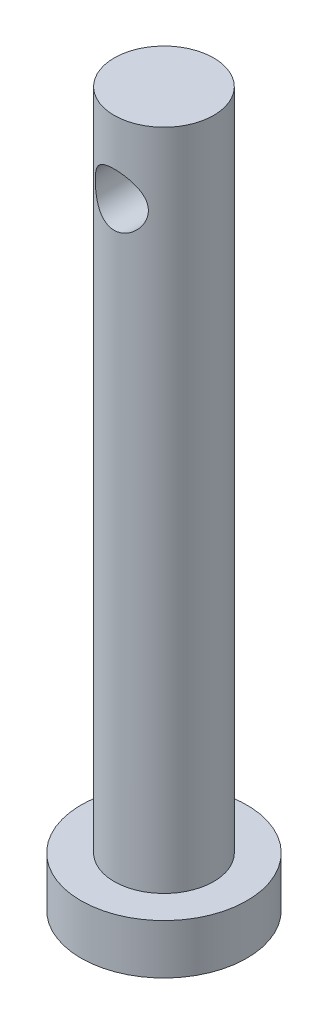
ISO-10303-21;
HEADER;
FILE_DESCRIPTION(('STEP AP214'),'2;1');
FILE_NAME('part.step','',(''),(''),'','','');
FILE_SCHEMA(('AUTOMOTIVE_DESIGN { 1 0 10303 214 1 1 1 1 }'));
ENDSEC;
DATA;
#1=APPLICATION_CONTEXT('core data for automotive mechanical design processes');
#2=APPLICATION_PROTOCOL_DEFINITION('international standard','automotive_design',2000,#1);
#3=PRODUCT_CONTEXT('',#1,'mechanical');
#4=PRODUCT('Part','Part','',(#3));
#5=PRODUCT_RELATED_PRODUCT_CATEGORY('part','',(#4));
#6=PRODUCT_DEFINITION_FORMATION('','',#4);
#7=PRODUCT_DEFINITION_CONTEXT('part definition',#1,'design');
#8=PRODUCT_DEFINITION('design','',#6,#7);
#9=PRODUCT_DEFINITION_SHAPE('','',#8);
#10=(LENGTH_UNIT() NAMED_UNIT(*) SI_UNIT(.MILLI.,.METRE.));
#11=(NAMED_UNIT(*) PLANE_ANGLE_UNIT() SI_UNIT($,.RADIAN.));
#12=(NAMED_UNIT(*) SI_UNIT($,.STERADIAN.) SOLID_ANGLE_UNIT());
#13=UNCERTAINTY_MEASURE_WITH_UNIT(LENGTH_MEASURE(1.E-05),#10,'distance_accuracy_value','');
#14=(GEOMETRIC_REPRESENTATION_CONTEXT(3) GLOBAL_UNCERTAINTY_ASSIGNED_CONTEXT((#13)) GLOBAL_UNIT_ASSIGNED_CONTEXT((#10,
#11,#12)) REPRESENTATION_CONTEXT('',''));
#15=CARTESIAN_POINT('',(0.,0.,0.));
#16=DIRECTION('',(0.,0.,1.));
#17=DIRECTION('',(1.,0.,0.));
#18=AXIS2_PLACEMENT_3D('',#15,#16,#17);
#19=CARTESIAN_POINT('',(-1.5,21.5,0.));
#20=DIRECTION('',(0.,1.,0.));
#21=DIRECTION('',(1.,0.,0.));
#22=AXIS2_PLACEMENT_3D('',#19,#20,#21);
#23=PLANE('',#22);
#24=CARTESIAN_POINT('',(0.,21.5,0.));
#25=DIRECTION('',(0.,1.,0.));
#26=DIRECTION('',(0.,0.,1.));
#27=AXIS2_PLACEMENT_3D('',#24,#25,#26);
#28=CIRCLE('',#27,1.5);
#29=CARTESIAN_POINT('',(0.,21.5,1.5));
#30=VERTEX_POINT('',#29);
#31=EDGE_CURVE('E38',#30,#30,#28,.T.);
#32=ORIENTED_EDGE('',*,*,#31,.T.);
#33=EDGE_LOOP('',(#32));
#34=FACE_BOUND('',#33,.T.);
#35=ADVANCED_FACE('F15',(#34),#23,.T.);
#36=CARTESIAN_POINT('',(-2.5,1.5,0.));
#37=DIRECTION('',(0.,1.,0.));
#38=DIRECTION('',(1.,0.,0.));
#39=AXIS2_PLACEMENT_3D('',#36,#37,#38);
#40=PLANE('',#39);
#41=CARTESIAN_POINT('',(0.,1.5,0.));
#42=DIRECTION('',(0.,1.,0.));
#43=DIRECTION('',(0.,0.,1.));
#44=AXIS2_PLACEMENT_3D('',#41,#42,#43);
#45=CIRCLE('',#44,1.5);
#46=CARTESIAN_POINT('',(0.,1.5,1.5));
#47=VERTEX_POINT('',#46);
#48=EDGE_CURVE('E47',#47,#47,#45,.T.);
#49=ORIENTED_EDGE('',*,*,#48,.F.);
#50=EDGE_LOOP('',(#49));
#51=FACE_BOUND('',#50,.T.);
#52=CARTESIAN_POINT('',(0.,1.5,0.));
#53=DIRECTION('',(0.,1.,0.));
#54=DIRECTION('',(0.,0.,1.));
#55=AXIS2_PLACEMENT_3D('',#52,#53,#54);
#56=CIRCLE('',#55,2.5);
#57=CARTESIAN_POINT('',(0.,1.5,2.5));
#58=VERTEX_POINT('',#57);
#59=EDGE_CURVE('E10',#58,#58,#56,.T.);
#60=ORIENTED_EDGE('',*,*,#59,.T.);
#61=EDGE_LOOP('',(#60));
#62=FACE_BOUND('',#61,.T.);
#63=ADVANCED_FACE('F67',(#51,#62),#40,.T.);
#64=CARTESIAN_POINT('',(0.,0.,0.));
#65=DIRECTION('',(0.,-1.,0.));
#66=DIRECTION('',(0.,0.,-1.));
#67=AXIS2_PLACEMENT_3D('',#64,#65,#66);
#68=PLANE('',#67);
#69=CARTESIAN_POINT('',(0.,0.,0.));
#70=DIRECTION('',(0.,1.,0.));
#71=DIRECTION('',(0.,0.,1.));
#72=AXIS2_PLACEMENT_3D('',#69,#70,#71);
#73=CIRCLE('',#72,2.5);
#74=CARTESIAN_POINT('',(0.,0.,2.5));
#75=VERTEX_POINT('',#74);
#76=EDGE_CURVE('E28',#75,#75,#73,.T.);
#77=ORIENTED_EDGE('',*,*,#76,.F.);
#78=EDGE_LOOP('',(#77));
#79=FACE_BOUND('',#78,.T.);
#80=ADVANCED_FACE('F59',(#79),#68,.T.);
#81=CARTESIAN_POINT('',(0.,0.,0.));
#82=DIRECTION('',(0.,1.,0.));
#83=DIRECTION('',(0.,0.,1.));
#84=AXIS2_PLACEMENT_3D('',#81,#82,#83);
#85=CYLINDRICAL_SURFACE('',#84,2.5);
#86=ORIENTED_EDGE('',*,*,#59,.F.);
#87=EDGE_LOOP('',(#86));
#88=FACE_BOUND('',#87,.T.);
#89=ORIENTED_EDGE('',*,*,#76,.T.);
#90=EDGE_LOOP('',(#89));
#91=FACE_BOUND('',#90,.T.);
#92=ADVANCED_FACE('F56',(#88,#91),#85,.T.);
#93=CARTESIAN_POINT('',(0.,0.,0.));
#94=DIRECTION('',(0.,1.,0.));
#95=DIRECTION('',(0.,0.,1.));
#96=AXIS2_PLACEMENT_3D('',#93,#94,#95);
#97=CYLINDRICAL_SURFACE('',#96,1.5);
#98=CARTESIAN_POINT('',(0.,18.5,-1.5));
#99=CARTESIAN_POINT('',(-0.0417534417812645,18.5000008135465,-1.49999924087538));
#100=CARTESIAN_POINT('',(-0.083514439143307,18.5032844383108,-1.49824053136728));
#101=CARTESIAN_POINT('',(-0.165754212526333,18.5162519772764,-1.49138572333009));
#102=CARTESIAN_POINT('',(-0.206232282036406,18.5259393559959,-1.48628781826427));
#103=CARTESIAN_POINT('',(-0.284636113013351,18.5512184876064,-1.47328110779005));
#104=CARTESIAN_POINT('',(-0.322570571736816,18.5667887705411,-1.46538252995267));
#105=CARTESIAN_POINT('',(-0.395228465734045,18.6032585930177,-1.44747938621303));
#106=CARTESIAN_POINT('',(-0.429951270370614,18.6241591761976,-1.43747440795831));
#107=CARTESIAN_POINT('',(-0.497766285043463,18.6722506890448,-1.41547938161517));
#108=CARTESIAN_POINT('',(-0.530599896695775,18.6997655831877,-1.40340192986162));
#109=CARTESIAN_POINT('',(-0.59143221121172,18.7596012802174,-1.37887123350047));
#110=CARTESIAN_POINT('',(-0.619426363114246,18.7919265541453,-1.36641764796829));
#111=CARTESIAN_POINT('',(-0.672363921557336,18.8639901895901,-1.34121681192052));
#112=CARTESIAN_POINT('',(-0.696793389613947,18.9041362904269,-1.32854705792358));
#113=CARTESIAN_POINT('',(-0.738438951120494,18.9886804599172,-1.30586143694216));
#114=CARTESIAN_POINT('',(-0.755665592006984,19.0330721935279,-1.29584169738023));
#115=CARTESIAN_POINT('',(-0.779091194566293,19.114559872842,-1.28185757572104));
#116=CARTESIAN_POINT('',(-0.786899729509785,19.1510483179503,-1.27703777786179));
#117=CARTESIAN_POINT('',(-0.797352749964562,19.2250229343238,-1.27053834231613));
#118=CARTESIAN_POINT('',(-0.800000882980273,19.2625083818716,-1.2688564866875));
#119=CARTESIAN_POINT('',(-0.799999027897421,19.3412757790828,-1.26885914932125));
#120=CARTESIAN_POINT('',(-0.796787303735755,19.3825590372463,-1.27090058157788));
#121=CARTESIAN_POINT('',(-0.784132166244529,19.4638017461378,-1.2787452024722));
#122=CARTESIAN_POINT('',(-0.774683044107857,19.5037599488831,-1.28455183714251));
#123=CARTESIAN_POINT('',(-0.750098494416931,19.5810506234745,-1.29905829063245));
#124=CARTESIAN_POINT('',(-0.73499450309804,19.6183962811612,-1.30774208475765));
#125=CARTESIAN_POINT('',(-0.699630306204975,19.6900186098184,-1.32699730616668));
#126=CARTESIAN_POINT('',(-0.679368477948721,19.7242943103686,-1.33756932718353));
#127=CARTESIAN_POINT('',(-0.632024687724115,19.792363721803,-1.36062514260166));
#128=CARTESIAN_POINT('',(-0.604479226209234,19.8258059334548,-1.37319519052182));
#129=CARTESIAN_POINT('',(-0.54430635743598,19.8878779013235,-1.3981387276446));
#130=CARTESIAN_POINT('',(-0.511675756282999,19.9165046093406,-1.41051208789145));
#131=CARTESIAN_POINT('',(-0.439097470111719,19.9703683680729,-1.43484177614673));
#132=CARTESIAN_POINT('',(-0.398774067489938,19.9951541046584,-1.44668647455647));
#133=CARTESIAN_POINT('',(-0.313792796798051,20.0374129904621,-1.4674597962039));
#134=CARTESIAN_POINT('',(-0.269140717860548,20.0548957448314,-1.47639224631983));
#135=CARTESIAN_POINT('',(-0.187070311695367,20.0787217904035,-1.48873428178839));
#136=CARTESIAN_POINT('',(-0.150231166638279,20.0866722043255,-1.49292777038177));
#137=CARTESIAN_POINT('',(-0.0755965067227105,20.097310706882,-1.49856046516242));
#138=CARTESIAN_POINT('',(-0.0378013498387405,20.1000007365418,-1.50000068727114));
#139=CARTESIAN_POINT('',(0.0417534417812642,20.0999991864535,-1.49999924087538));
#140=CARTESIAN_POINT('',(0.0835144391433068,20.0967155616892,-1.49824053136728));
#141=CARTESIAN_POINT('',(0.165754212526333,20.0837480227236,-1.49138572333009));
#142=CARTESIAN_POINT('',(0.206232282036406,20.0740606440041,-1.48628781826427));
#143=CARTESIAN_POINT('',(0.284636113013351,20.0487815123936,-1.47328110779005));
#144=CARTESIAN_POINT('',(0.322570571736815,20.0332112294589,-1.46538252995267));
#145=CARTESIAN_POINT('',(0.395228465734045,19.9967414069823,-1.44747938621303));
#146=CARTESIAN_POINT('',(0.429951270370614,19.9758408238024,-1.43747440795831));
#147=CARTESIAN_POINT('',(0.497766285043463,19.9277493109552,-1.41547938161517));
#148=CARTESIAN_POINT('',(0.530599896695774,19.9002344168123,-1.40340192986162));
#149=CARTESIAN_POINT('',(0.59143221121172,19.8403987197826,-1.37887123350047));
#150=CARTESIAN_POINT('',(0.619426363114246,19.8080734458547,-1.36641764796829));
#151=CARTESIAN_POINT('',(0.672363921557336,19.7360098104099,-1.34121681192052));
#152=CARTESIAN_POINT('',(0.696793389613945,19.6958637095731,-1.32854705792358));
#153=CARTESIAN_POINT('',(0.738438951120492,19.6113195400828,-1.30586143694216));
#154=CARTESIAN_POINT('',(0.755665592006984,19.5669278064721,-1.29584169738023));
#155=CARTESIAN_POINT('',(0.779091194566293,19.485440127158,-1.28185757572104));
#156=CARTESIAN_POINT('',(0.786899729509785,19.4489516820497,-1.27703777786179));
#157=CARTESIAN_POINT('',(0.797352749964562,19.3749770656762,-1.27053834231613));
#158=CARTESIAN_POINT('',(0.800000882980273,19.3374916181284,-1.2688564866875));
#159=CARTESIAN_POINT('',(0.799999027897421,19.2587242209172,-1.26885914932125));
#160=CARTESIAN_POINT('',(0.796787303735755,19.2174409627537,-1.27090058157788));
#161=CARTESIAN_POINT('',(0.784132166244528,19.1361982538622,-1.2787452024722));
#162=CARTESIAN_POINT('',(0.774683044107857,19.0962400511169,-1.28455183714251));
#163=CARTESIAN_POINT('',(0.750098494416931,19.0189493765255,-1.29905829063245));
#164=CARTESIAN_POINT('',(0.734994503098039,18.9816037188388,-1.30774208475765));
#165=CARTESIAN_POINT('',(0.699630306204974,18.9099813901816,-1.32699730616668));
#166=CARTESIAN_POINT('',(0.67936847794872,18.8757056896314,-1.33756932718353));
#167=CARTESIAN_POINT('',(0.632024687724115,18.807636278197,-1.36062514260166));
#168=CARTESIAN_POINT('',(0.604479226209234,18.7741940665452,-1.37319519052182));
#169=CARTESIAN_POINT('',(0.54430635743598,18.7121220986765,-1.3981387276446));
#170=CARTESIAN_POINT('',(0.511675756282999,18.6834953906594,-1.41051208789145));
#171=CARTESIAN_POINT('',(0.43909747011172,18.6296316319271,-1.43484177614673));
#172=CARTESIAN_POINT('',(0.398774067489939,18.6048458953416,-1.44668647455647));
#173=CARTESIAN_POINT('',(0.313792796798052,18.5625870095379,-1.4674597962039));
#174=CARTESIAN_POINT('',(0.269140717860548,18.5451042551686,-1.47639224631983));
#175=CARTESIAN_POINT('',(0.187070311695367,18.5212782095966,-1.48873428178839));
#176=CARTESIAN_POINT('',(0.150231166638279,18.5133277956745,-1.49292777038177));
#177=CARTESIAN_POINT('',(0.0755965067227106,18.502689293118,-1.49856046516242));
#178=CARTESIAN_POINT('',(0.0378013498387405,18.4999992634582,-1.50000068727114));
#179=CARTESIAN_POINT('',(0.,18.5,-1.5));
#180=B_SPLINE_CURVE_WITH_KNOTS('',3,(#98,#99,#100,#101,#102,#103,#104,#105,#106,#107,#108,#109,
#110,#111,#112,#113,#114,#115,#116,#117,#118,#119,#120,#121,#122,#123,#124,#125,#126,#127,#128,
#129,#130,#131,#132,#133,#134,#135,#136,#137,#138,#139,#140,#141,#142,#143,#144,#145,#146,#147,
#148,#149,#150,#151,#152,#153,#154,#155,#156,#157,#158,#159,#160,#161,#162,#163,#164,#165,#166,
#167,#168,#169,#170,#171,#172,#173,#174,#175,#176,#177,#178,#179),.UNSPECIFIED.,.T.,.F.,(4,2,2,
2,2,2,2,2,2,2,2,2,2,2,2,2,2,2,2,2,2,2,2,2,2,2,2,2,2,2,2,2,2,2,2,2,2,2,2,2,4),(0.,
0.125112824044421,0.250293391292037,0.375021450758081,0.499773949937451,0.632754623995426,
0.765859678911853,0.911150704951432,1.05622822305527,1.16864361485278,1.28097951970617,
1.40465388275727,1.52844159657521,1.65155113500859,1.77469945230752,1.90948281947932,
2.04435118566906,2.18995700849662,2.3353707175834,2.44868304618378,2.5619535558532,
2.68706637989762,2.81224694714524,2.93697500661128,3.06172750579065,3.19470817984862,
3.32781323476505,3.47310426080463,3.61818177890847,3.73059717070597,3.84293307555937,
3.96660743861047,4.09039515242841,4.21350469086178,4.33665300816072,4.47143637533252,
4.60630474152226,4.75191056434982,4.8973242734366,5.01063660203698,5.1239071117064),.UNSPECIFIED.);
#181=CARTESIAN_POINT('',(0.,18.5,-1.5));
#182=VERTEX_POINT('',#181);
#183=EDGE_CURVE('E18',#182,#182,#180,.T.);
#184=ORIENTED_EDGE('',*,*,#183,.F.);
#185=EDGE_LOOP('',(#184));
#186=FACE_BOUND('',#185,.T.);
#187=ORIENTED_EDGE('',*,*,#31,.F.);
#188=EDGE_LOOP('',(#187));
#189=FACE_BOUND('',#188,.T.);
#190=ORIENTED_EDGE('',*,*,#48,.T.);
#191=EDGE_LOOP('',(#190));
#192=FACE_BOUND('',#191,.T.);
#193=CARTESIAN_POINT('',(-0.8,19.3,1.26885775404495));
#194=CARTESIAN_POINT('',(-0.799999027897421,19.2587242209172,1.26885914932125));
#195=CARTESIAN_POINT('',(-0.796787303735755,19.2174409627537,1.27090058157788));
#196=CARTESIAN_POINT('',(-0.784132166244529,19.1361982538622,1.2787452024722));
#197=CARTESIAN_POINT('',(-0.774683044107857,19.0962400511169,1.28455183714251));
#198=CARTESIAN_POINT('',(-0.750098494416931,19.0189493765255,1.29905829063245));
#199=CARTESIAN_POINT('',(-0.73499450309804,18.9816037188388,1.30774208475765));
#200=CARTESIAN_POINT('',(-0.699630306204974,18.9099813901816,1.32699730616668));
#201=CARTESIAN_POINT('',(-0.67936847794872,18.8757056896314,1.33756932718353));
#202=CARTESIAN_POINT('',(-0.632024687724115,18.807636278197,1.36062514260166));
#203=CARTESIAN_POINT('',(-0.604479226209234,18.7741940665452,1.37319519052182));
#204=CARTESIAN_POINT('',(-0.54430635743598,18.7121220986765,1.3981387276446));
#205=CARTESIAN_POINT('',(-0.511675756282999,18.6834953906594,1.41051208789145));
#206=CARTESIAN_POINT('',(-0.439097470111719,18.6296316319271,1.43484177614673));
#207=CARTESIAN_POINT('',(-0.398774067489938,18.6048458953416,1.44668647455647));
#208=CARTESIAN_POINT('',(-0.31379279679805,18.5625870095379,1.4674597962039));
#209=CARTESIAN_POINT('',(-0.269140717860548,18.5451042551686,1.47639224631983));
#210=CARTESIAN_POINT('',(-0.187070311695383,18.5212782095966,1.48873428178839));
#211=CARTESIAN_POINT('',(-0.150231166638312,18.5133277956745,1.49292777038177));
#212=CARTESIAN_POINT('',(-0.0755965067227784,18.5026892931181,1.49856046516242));
#213=CARTESIAN_POINT('',(-0.0378013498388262,18.4999992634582,1.50000068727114));
#214=CARTESIAN_POINT('',(0.0417534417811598,18.5000008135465,1.49999924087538));
#215=CARTESIAN_POINT('',(0.0835144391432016,18.5032844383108,1.49824053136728));
#216=CARTESIAN_POINT('',(0.165754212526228,18.5162519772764,1.49138572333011));
#217=CARTESIAN_POINT('',(0.206232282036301,18.5259393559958,1.48628781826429));
#218=CARTESIAN_POINT('',(0.284636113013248,18.5512184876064,1.47328110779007));
#219=CARTESIAN_POINT('',(0.322570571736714,18.5667887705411,1.4653825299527));
#220=CARTESIAN_POINT('',(0.395228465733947,18.6032585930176,1.44747938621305));
#221=CARTESIAN_POINT('',(0.429951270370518,18.6241591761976,1.43747440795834));
#222=CARTESIAN_POINT('',(0.497766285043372,18.6722506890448,1.4154793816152));
#223=CARTESIAN_POINT('',(0.530599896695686,18.6997655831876,1.40340192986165));
#224=CARTESIAN_POINT('',(0.591432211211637,18.7596012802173,1.37887123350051));
#225=CARTESIAN_POINT('',(0.619426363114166,18.7919265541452,1.36641764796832));
#226=CARTESIAN_POINT('',(0.672363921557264,18.86399018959,1.34121681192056));
#227=CARTESIAN_POINT('',(0.696793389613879,18.9041362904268,1.32854705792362));
#228=CARTESIAN_POINT('',(0.73843895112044,18.9886804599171,1.30586143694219));
#229=CARTESIAN_POINT('',(0.755665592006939,19.0330721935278,1.29584169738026));
#230=CARTESIAN_POINT('',(0.77909119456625,19.1145598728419,1.28185757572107));
#231=CARTESIAN_POINT('',(0.786899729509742,19.1510483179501,1.27703777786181));
#232=CARTESIAN_POINT('',(0.797352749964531,19.2250229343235,1.27053834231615));
#233=CARTESIAN_POINT('',(0.800000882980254,19.2625083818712,1.26885648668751));
#234=CARTESIAN_POINT('',(0.799999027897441,19.3412757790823,1.26885914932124));
#235=CARTESIAN_POINT('',(0.796787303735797,19.3825590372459,1.27090058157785));
#236=CARTESIAN_POINT('',(0.784132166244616,19.4638017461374,1.27874520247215));
#237=CARTESIAN_POINT('',(0.774683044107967,19.5037599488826,1.28455183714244));
#238=CARTESIAN_POINT('',(0.750098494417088,19.5810506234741,1.29905829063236));
#239=CARTESIAN_POINT('',(0.734994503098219,19.6183962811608,1.30774208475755));
#240=CARTESIAN_POINT('',(0.699630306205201,19.690018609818,1.32699730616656));
#241=CARTESIAN_POINT('',(0.679368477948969,19.7242943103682,1.33756932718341));
#242=CARTESIAN_POINT('',(0.632024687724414,19.7923637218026,1.36062514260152));
#243=CARTESIAN_POINT('',(0.604479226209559,19.8258059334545,1.37319519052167));
#244=CARTESIAN_POINT('',(0.54430635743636,19.8878779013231,1.39813872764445));
#245=CARTESIAN_POINT('',(0.511675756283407,19.9165046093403,1.4105120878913));
#246=CARTESIAN_POINT('',(0.439097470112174,19.9703683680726,1.43484177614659));
#247=CARTESIAN_POINT('',(0.398774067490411,19.9951541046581,1.44668647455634));
#248=CARTESIAN_POINT('',(0.313792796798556,20.0374129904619,1.46745979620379));
#249=CARTESIAN_POINT('',(0.269140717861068,20.0548957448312,1.47639224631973));
#250=CARTESIAN_POINT('',(0.187070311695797,20.0787217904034,1.48873428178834));
#251=CARTESIAN_POINT('',(0.150231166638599,20.0866722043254,1.49292777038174));
#252=CARTESIAN_POINT('',(0.0755965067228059,20.0973107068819,1.49856046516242));
#253=CARTESIAN_POINT('',(0.0378013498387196,20.1000007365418,1.50000068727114));
#254=CARTESIAN_POINT('',(-0.0417534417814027,20.0999991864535,1.49999924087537));
#255=CARTESIAN_POINT('',(-0.0835144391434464,20.0967155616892,1.49824053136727));
#256=CARTESIAN_POINT('',(-0.165754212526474,20.0837480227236,1.49138572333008));
#257=CARTESIAN_POINT('',(-0.206232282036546,20.0740606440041,1.48628781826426));
#258=CARTESIAN_POINT('',(-0.284636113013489,20.0487815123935,1.47328110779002));
#259=CARTESIAN_POINT('',(-0.322570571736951,20.0332112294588,1.46538252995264));
#260=CARTESIAN_POINT('',(-0.395228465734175,19.9967414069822,1.44747938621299));
#261=CARTESIAN_POINT('',(-0.429951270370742,19.9758408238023,1.43747440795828));
#262=CARTESIAN_POINT('',(-0.497766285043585,19.9277493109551,1.41547938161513));
#263=CARTESIAN_POINT('',(-0.530599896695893,19.9002344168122,1.40340192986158));
#264=CARTESIAN_POINT('',(-0.59143221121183,19.8403987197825,1.37887123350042));
#265=CARTESIAN_POINT('',(-0.619426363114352,19.8080734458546,1.36641764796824));
#266=CARTESIAN_POINT('',(-0.672363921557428,19.7360098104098,1.34121681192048));
#267=CARTESIAN_POINT('',(-0.696793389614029,19.695863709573,1.32854705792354));
#268=CARTESIAN_POINT('',(-0.73843895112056,19.6113195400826,1.30586143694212));
#269=CARTESIAN_POINT('',(-0.755665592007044,19.5669278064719,1.29584169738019));
#270=CARTESIAN_POINT('',(-0.779091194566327,19.4854401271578,1.28185757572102));
#271=CARTESIAN_POINT('',(-0.786899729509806,19.4489516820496,1.27703777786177));
#272=CARTESIAN_POINT('',(-0.797352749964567,19.3749770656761,1.27053834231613));
#273=CARTESIAN_POINT('',(-0.800000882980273,19.3374916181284,1.2688564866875));
#274=CARTESIAN_POINT('',(-0.8,19.3,1.26885775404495));
#275=B_SPLINE_CURVE_WITH_KNOTS('',3,(#193,#194,#195,#196,#197,#198,#199,#200,#201,#202,#203,
#204,#205,#206,#207,#208,#209,#210,#211,#212,#213,#214,#215,#216,#217,#218,#219,#220,#221,#222,
#223,#224,#225,#226,#227,#228,#229,#230,#231,#232,#233,#234,#235,#236,#237,#238,#239,#240,#241,
#242,#243,#244,#245,#246,#247,#248,#249,#250,#251,#252,#253,#254,#255,#256,#257,#258,#259,#260,
#261,#262,#263,#264,#265,#266,#267,#268,#269,#270,#271,#272,#273,#274),.UNSPECIFIED.,.T.,.F.,(4,
2,2,2,2,2,2,2,2,2,2,2,2,2,2,2,2,2,2,2,2,2,2,2,2,2,2,2,2,2,2,2,2,2,2,2,2,2,2,2,4),(0.,
0.1236743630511,0.247462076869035,0.370571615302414,0.493719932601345,0.628503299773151,
0.763371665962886,0.908977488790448,1.05439119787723,1.16770352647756,1.28097403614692,
1.40608686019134,1.53126742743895,1.65599548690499,1.78074798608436,1.91372866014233,
2.04683371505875,2.19212474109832,2.33720225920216,2.44961765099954,2.5619535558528,
2.68562791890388,2.80941563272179,2.93252517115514,3.05567348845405,3.19045685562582,
3.32532522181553,3.47093104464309,3.61634475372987,3.7296570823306,3.84292759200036,
3.96804041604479,4.09322098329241,4.21794904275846,4.34270154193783,4.47568221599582,
4.60878727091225,4.75407829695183,4.89915581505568,5.01157120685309,5.1239071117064),.UNSPECIFIED.);
#276=CARTESIAN_POINT('',(-0.8,19.3,1.26885775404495));
#277=VERTEX_POINT('',#276);
#278=EDGE_CURVE('E41',#277,#277,#275,.T.);
#279=ORIENTED_EDGE('',*,*,#278,.F.);
#280=EDGE_LOOP('',(#279));
#281=FACE_BOUND('',#280,.T.);
#282=ADVANCED_FACE('F48',(#186,#189,#192,#281),#97,.T.);
#283=CARTESIAN_POINT('',(0.,19.3,-5.));
#284=DIRECTION('',(0.,0.,1.));
#285=DIRECTION('',(1.,0.,0.));
#286=AXIS2_PLACEMENT_3D('',#283,#284,#285);
#287=CYLINDRICAL_SURFACE('',#286,0.8);
#288=ORIENTED_EDGE('',*,*,#278,.T.);
#289=EDGE_LOOP('',(#288));
#290=FACE_BOUND('',#289,.T.);
#291=ORIENTED_EDGE('',*,*,#183,.T.);
#292=EDGE_LOOP('',(#291));
#293=FACE_BOUND('',#292,.T.);
#294=ADVANCED_FACE('F52',(#290,#293),#287,.F.);
#295=CLOSED_SHELL('',(#35,#63,#80,#92,#282,#294));
#296=MANIFOLD_SOLID_BREP('B1',#295);
#297=ADVANCED_BREP_SHAPE_REPRESENTATION('',(#18,#296),#14);
#298=SHAPE_DEFINITION_REPRESENTATION(#9,#297);
ENDSEC;
END-ISO-10303-21;
